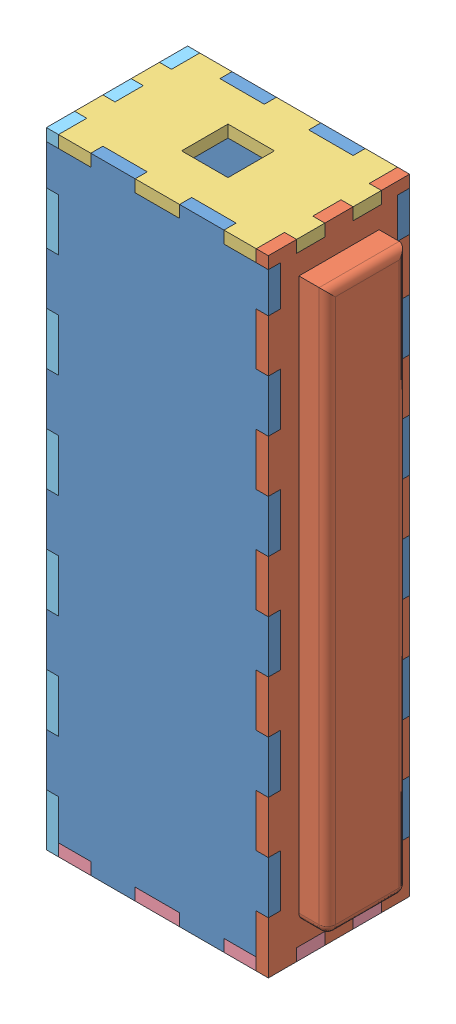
SolidWorks assembly Inside-box.SLDASM, configuration Default (file format 9000). Lengths in mm.
Overall size (62 155 35).
6 component instances, 5 part files, 14 mates.
Components (placement in the parent):
- inside-back-1: inside-back.SLDPRT [Default] at (32.5032 66.7137 139.4842) size (55 155 3)
- Inside-wiring-left-5: Inside-wiring-left.SLDPRT [Default] at (57.0032 66.7137 156.9842) x (0 0 -1) z (1 0 0) size (35 155 10)
- Inside-Right-5: Inside-Right.SLDPRT [Default] at (32.5032 141.2137 156.9842) x (0 1 0) z (1 0 0) size (3 35 55)
- Inside-2-5: Inside-2.SLDPRT [Default] at (32.5032 -10.7863 156.9842) x (0 1 0) z (1 0 0) size (3 35 55)
- Inside-left-7: Inside-left.SLDPRT [Default] at (5.0032 66.7137 156.9842) x (0 0 -1) z (1 0 0) size (35 155 3)
- inside-back-2: inside-back.SLDPRT [Default] at (32.5032 66.7137 171.4842) size (55 155 3)
Mates (geometry in assembly coordinates):
- Coincident10: coincident anti-aligned: plane of inside-back-1 through (57.0032 66.7137 139.4842) normal (1 0 0); plane of Inside-wiring-left-5 through (57.0032 66.7137 156.9842) normal (-1 0 0)
- Coincident11: coincident aligned: plane of inside-back-1 through (32.5032 66.7137 139.4842) normal (0 0 -1); plane of Inside-wiring-left-5 through (60.0032 144.2137 139.4842) normal (0 0 -1)
- Coincident12: coincident anti-aligned: plane of inside-back-1 through (32.5032 27.9637 139.4842) normal (0 -1 0); plane of Inside-wiring-left-5 through (16.0032 27.9637 156.9842) normal (0 1 0)
- Coincident22: coincident aligned: plane of Inside-wiring-left-5 through (60.0032 144.2137 146.4842) normal (0 1 0); plane of Inside-Right-5 through (32.5032 144.2137 156.9842) normal (0 1 0)
- Coincident23: coincident aligned: plane of inside-back-1 through (32.5032 66.7137 139.4842) normal (0 0 -1); plane of Inside-Right-5 through (60.0032 144.2137 139.4842) normal (0 0 -1)
- Coincident25: coincident aligned: plane of Inside-wiring-left-5 through (60.0032 -10.7863 174.4842) normal (0 -1 0); plane of Inside-2-5 through (32.5032 -10.7863 156.9842) normal (0 -1 0)
- Coincident26: coincident aligned: plane of Inside-wiring-left-5 through (60.0032 144.2137 174.4842) normal (0 0 1); plane of Inside-2-5 through (60.0032 -7.7863 174.4842) normal (0 0 1)
- Coincident27: coincident aligned: plane of Inside-wiring-left-5 through (60.0032 66.7137 156.9842) normal (1 0 0); plane of Inside-2-5 through (60.0032 -7.7863 174.4842) normal (1 0 0)
- Coincident28: coincident aligned: plane of inside-back-1 through (5.0032 144.2137 142.4842) normal (-1 0 0); plane of Inside-left-7 through (5.0032 66.7137 156.9842) normal (-1 0 0)
- Coincident29: coincident aligned: plane of Inside-Right-5 through (32.5032 144.2137 156.9842) normal (0 1 0); plane of Inside-left-7 through (8.0032 144.2137 160.4842) normal (0 1 0)
- Coincident33: coincident anti-aligned: plane of Inside-2-5 through (32.5032 -10.7863 146.4842) normal (0 0 -1); plane of Inside-left-7 through (8.0032 -7.7863 146.4842) normal (0 0 1)
- Coincident34: coincident anti-aligned: plane of Inside-2-5 through (32.5032 -10.7863 171.4842) normal (0 0 1); plane of inside-back-2 through (32.5032 66.7137 171.4842) normal (0 0 -1)
- Coincident35: coincident anti-aligned: plane of Inside-left-7 through (8.0032 66.7137 156.9842) normal (1 0 0); plane of inside-back-2 through (8.0032 66.7137 171.4842) normal (-1 0 0)
- Coincident36: coincident aligned: plane of Inside-Right-5 through (32.5032 144.2137 156.9842) normal (0 1 0); plane of inside-back-2 through (5.0032 144.2137 174.4842) normal (0 1 0)
